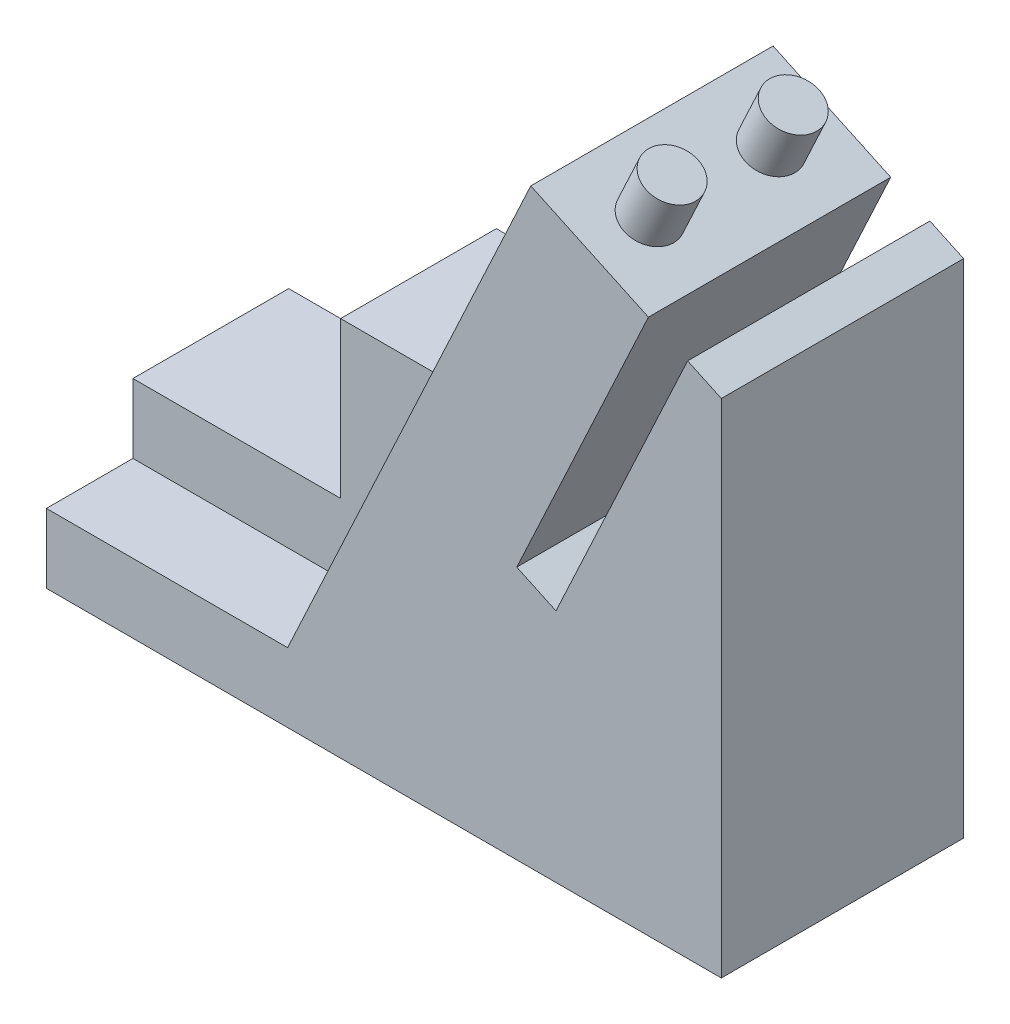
from build123d import *

# Parameters (mm, degrees)
BOSS_EXTRUDE1_DEPTH = 28
CUT_EXTRUDE1_REACH  = 109.371
CUT_EXTRUDE2_DEPTH  = 10
SKETCH4_R           = 3
BOSS_EXTRUDE2_DEPTH = 6


with BuildPart() as part:
    # Sketch1 → Boss-Extrude1 (new body)
    with BuildSketch(Plane.XY):
        Polygon((0, 0), (78, 0), (78, 58), (55.979568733, 68.268295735), (40, 34), (24, 34), (24, 16), (0, 16), align=None)
    extrude(amount=BOSS_EXTRUDE1_DEPTH)

    # Sketch2 → Cut-Extrude1 (cut, up to next)
    with BuildSketch(Plane.XY.offset(28), mode=Mode.PRIVATE) as cut_extrude1_sk1:
        Polygon((74.105724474, 59.815930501), (69.574185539, 61.929021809), (54.359928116, 29.301941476), (58.891467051, 27.188850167), align=None)
    cut_extrude1_tool1 = extrude(cut_extrude1_sk1.sketch, amount=-CUT_EXTRUDE1_REACH, mode=Mode.PRIVATE) & part.part
    add(cut_extrude1_tool1.solids().sort_by_distance((64.232826, 44.558936, 28))[0], mode=Mode.SUBTRACT)

    # Sketch3 → Cut-Extrude2 (cut)
    with BuildSketch(Plane.XY.offset(28)):
        Polygon((0, 8), (27.876000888, 8), (40, 34), (24, 34), (24, 16), (0, 16), align=None)
    extrude(amount=-CUT_EXTRUDE2_DEPTH, mode=Mode.SUBTRACT)

    # Sketch4 → Boss-Extrude2 (add)
    with BuildSketch(Plane(origin=(36.146572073, 77.516573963, 0), x_dir=(0.9063077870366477, -0.42261826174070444, 0), z_dir=(0.42261826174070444, 0.9063077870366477, 0))):
        with Locations((29.383290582, -7)):
            Circle(SKETCH4_R)
        with Locations((29.383290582, -21)):
            Circle(SKETCH4_R)
    extrude(amount=BOSS_EXTRUDE2_DEPTH)


solid = part.part
